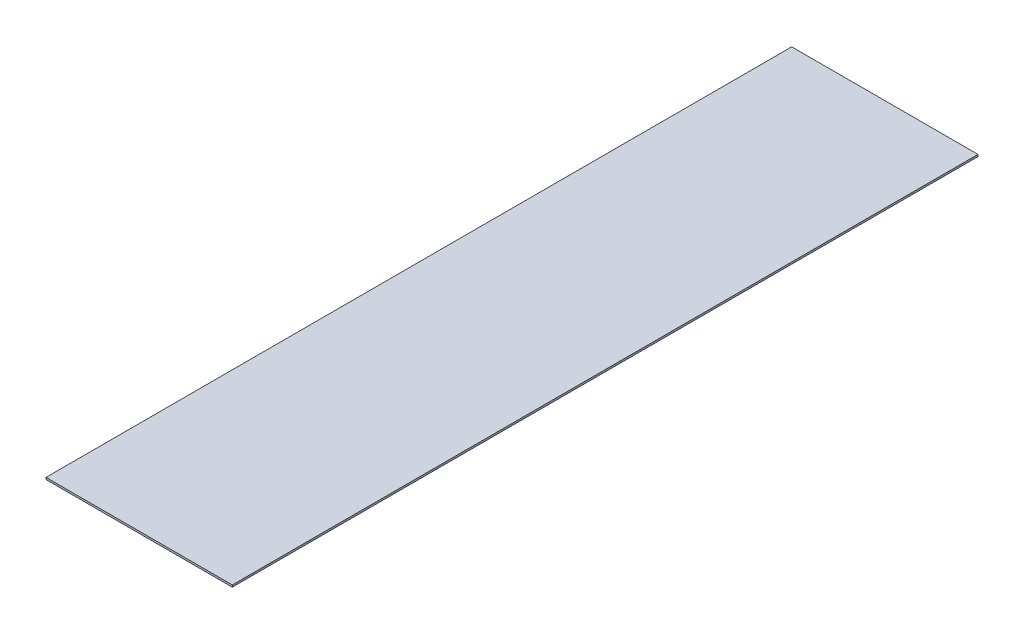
ISO-10303-21;
HEADER;
FILE_DESCRIPTION(('STEP AP214'),'2;1');
FILE_NAME('part.step','',(''),(''),'','','');
FILE_SCHEMA(('AUTOMOTIVE_DESIGN { 1 0 10303 214 1 1 1 1 }'));
ENDSEC;
DATA;
#1=APPLICATION_CONTEXT('core data for automotive mechanical design processes');
#2=APPLICATION_PROTOCOL_DEFINITION('international standard','automotive_design',2000,#1);
#3=PRODUCT_CONTEXT('',#1,'mechanical');
#4=PRODUCT('Part','Part','',(#3));
#5=PRODUCT_RELATED_PRODUCT_CATEGORY('part','',(#4));
#6=PRODUCT_DEFINITION_FORMATION('','',#4);
#7=PRODUCT_DEFINITION_CONTEXT('part definition',#1,'design');
#8=PRODUCT_DEFINITION('design','',#6,#7);
#9=PRODUCT_DEFINITION_SHAPE('','',#8);
#10=(LENGTH_UNIT() NAMED_UNIT(*) SI_UNIT(.MILLI.,.METRE.));
#11=(NAMED_UNIT(*) PLANE_ANGLE_UNIT() SI_UNIT($,.RADIAN.));
#12=(NAMED_UNIT(*) SI_UNIT($,.STERADIAN.) SOLID_ANGLE_UNIT());
#13=UNCERTAINTY_MEASURE_WITH_UNIT(LENGTH_MEASURE(1.E-05),#10,'distance_accuracy_value','');
#14=(GEOMETRIC_REPRESENTATION_CONTEXT(3) GLOBAL_UNCERTAINTY_ASSIGNED_CONTEXT((#13)) GLOBAL_UNIT_ASSIGNED_CONTEXT((#10,
#11,#12)) REPRESENTATION_CONTEXT('',''));
#15=CARTESIAN_POINT('',(0.,0.,0.));
#16=DIRECTION('',(0.,0.,1.));
#17=DIRECTION('',(1.,0.,0.));
#18=AXIS2_PLACEMENT_3D('',#15,#16,#17);
#19=CARTESIAN_POINT('',(-304.8,6.35,-1219.99375));
#20=DIRECTION('',(1.,0.,0.));
#21=DIRECTION('',(0.,0.,-1.));
#22=AXIS2_PLACEMENT_3D('',#19,#20,#21);
#23=PLANE('',#22);
#24=DIRECTION('',(0.,0.,1.));
#25=VECTOR('',#24,1.);
#26=CARTESIAN_POINT('',(-304.8,0.,-1219.99375));
#27=LINE('',#26,#25);
#28=CARTESIAN_POINT('',(-304.8,0.,-1219.99375));
#29=VERTEX_POINT('',#28);
#30=CARTESIAN_POINT('',(-304.8,0.,1219.99375));
#31=VERTEX_POINT('',#30);
#32=EDGE_CURVE('E96',#29,#31,#27,.T.);
#33=ORIENTED_EDGE('',*,*,#32,.T.);
#34=DIRECTION('',(0.,-1.,0.));
#35=VECTOR('',#34,1.);
#36=CARTESIAN_POINT('',(-304.8,6.35,1219.99375));
#37=LINE('',#36,#35);
#38=CARTESIAN_POINT('',(-304.8,6.35,1219.99375));
#39=VERTEX_POINT('',#38);
#40=EDGE_CURVE('E11',#39,#31,#37,.T.);
#41=ORIENTED_EDGE('',*,*,#40,.F.);
#42=DIRECTION('',(0.,0.,1.));
#43=VECTOR('',#42,1.);
#44=CARTESIAN_POINT('',(-304.8,6.35,-1219.99375));
#45=LINE('',#44,#43);
#46=CARTESIAN_POINT('',(-304.8,6.35,-1219.99375));
#47=VERTEX_POINT('',#46);
#48=EDGE_CURVE('E84',#47,#39,#45,.T.);
#49=ORIENTED_EDGE('',*,*,#48,.F.);
#50=DIRECTION('',(0.,-1.,0.));
#51=VECTOR('',#50,1.);
#52=CARTESIAN_POINT('',(-304.8,6.35,-1219.99375));
#53=LINE('',#52,#51);
#54=EDGE_CURVE('E92',#47,#29,#53,.T.);
#55=ORIENTED_EDGE('',*,*,#54,.T.);
#56=EDGE_LOOP('',(#33,#41,#49,#55));
#57=FACE_BOUND('',#56,.T.);
#58=ADVANCED_FACE('F33',(#57),#23,.F.);
#59=CARTESIAN_POINT('',(-304.8,6.35,1219.99375));
#60=DIRECTION('',(0.,0.,-1.));
#61=DIRECTION('',(-1.,0.,0.));
#62=AXIS2_PLACEMENT_3D('',#59,#60,#61);
#63=PLANE('',#62);
#64=DIRECTION('',(1.,0.,0.));
#65=VECTOR('',#64,1.);
#66=CARTESIAN_POINT('',(-304.8,0.,1219.99375));
#67=LINE('',#66,#65);
#68=CARTESIAN_POINT('',(304.8,0.,1219.99375));
#69=VERTEX_POINT('',#68);
#70=EDGE_CURVE('E88',#31,#69,#67,.T.);
#71=ORIENTED_EDGE('',*,*,#70,.T.);
#72=DIRECTION('',(0.,-1.,0.));
#73=VECTOR('',#72,1.);
#74=CARTESIAN_POINT('',(304.8,6.35,1219.99375));
#75=LINE('',#74,#73);
#76=CARTESIAN_POINT('',(304.8,6.35,1219.99375));
#77=VERTEX_POINT('',#76);
#78=EDGE_CURVE('E41',#77,#69,#75,.T.);
#79=ORIENTED_EDGE('',*,*,#78,.F.);
#80=DIRECTION('',(1.,0.,0.));
#81=VECTOR('',#80,1.);
#82=CARTESIAN_POINT('',(-304.8,6.35,1219.99375));
#83=LINE('',#82,#81);
#84=EDGE_CURVE('E79',#39,#77,#83,.T.);
#85=ORIENTED_EDGE('',*,*,#84,.F.);
#86=ORIENTED_EDGE('',*,*,#40,.T.);
#87=EDGE_LOOP('',(#71,#79,#85,#86));
#88=FACE_BOUND('',#87,.T.);
#89=ADVANCED_FACE('F87',(#88),#63,.F.);
#90=CARTESIAN_POINT('',(304.8,6.35,-1219.99375));
#91=DIRECTION('',(-1.,0.,0.));
#92=DIRECTION('',(0.,0.,1.));
#93=AXIS2_PLACEMENT_3D('',#90,#91,#92);
#94=PLANE('',#93);
#95=DIRECTION('',(0.,0.,-1.));
#96=VECTOR('',#95,1.);
#97=CARTESIAN_POINT('',(304.8,0.,-1219.99375));
#98=LINE('',#97,#96);
#99=CARTESIAN_POINT('',(304.8,0.,-1219.99375));
#100=VERTEX_POINT('',#99);
#101=EDGE_CURVE('E66',#69,#100,#98,.T.);
#102=ORIENTED_EDGE('',*,*,#101,.T.);
#103=DIRECTION('',(0.,-1.,0.));
#104=VECTOR('',#103,1.);
#105=CARTESIAN_POINT('',(304.8,6.35,-1219.99375));
#106=LINE('',#105,#104);
#107=CARTESIAN_POINT('',(304.8,6.35,-1219.99375));
#108=VERTEX_POINT('',#107);
#109=EDGE_CURVE('E89',#108,#100,#106,.T.);
#110=ORIENTED_EDGE('',*,*,#109,.F.);
#111=DIRECTION('',(0.,0.,-1.));
#112=VECTOR('',#111,1.);
#113=CARTESIAN_POINT('',(304.8,6.35,-1219.99375));
#114=LINE('',#113,#112);
#115=EDGE_CURVE('E82',#77,#108,#114,.T.);
#116=ORIENTED_EDGE('',*,*,#115,.F.);
#117=ORIENTED_EDGE('',*,*,#78,.T.);
#118=EDGE_LOOP('',(#102,#110,#116,#117));
#119=FACE_BOUND('',#118,.T.);
#120=ADVANCED_FACE('F90',(#119),#94,.F.);
#121=CARTESIAN_POINT('',(-304.8,6.35,-1219.99375));
#122=DIRECTION('',(0.,0.,1.));
#123=DIRECTION('',(1.,0.,0.));
#124=AXIS2_PLACEMENT_3D('',#121,#122,#123);
#125=PLANE('',#124);
#126=DIRECTION('',(-1.,0.,0.));
#127=VECTOR('',#126,1.);
#128=CARTESIAN_POINT('',(-304.8,0.,-1219.99375));
#129=LINE('',#128,#127);
#130=EDGE_CURVE('E72',#100,#29,#129,.T.);
#131=ORIENTED_EDGE('',*,*,#130,.T.);
#132=ORIENTED_EDGE('',*,*,#54,.F.);
#133=DIRECTION('',(-1.,0.,0.));
#134=VECTOR('',#133,1.);
#135=CARTESIAN_POINT('',(-304.8,6.35,-1219.99375));
#136=LINE('',#135,#134);
#137=EDGE_CURVE('E49',#108,#47,#136,.T.);
#138=ORIENTED_EDGE('',*,*,#137,.F.);
#139=ORIENTED_EDGE('',*,*,#109,.T.);
#140=EDGE_LOOP('',(#131,#132,#138,#139));
#141=FACE_BOUND('',#140,.T.);
#142=ADVANCED_FACE('F103',(#141),#125,.F.);
#143=CARTESIAN_POINT('',(0.,6.35,0.));
#144=DIRECTION('',(0.,1.,0.));
#145=DIRECTION('',(0.,0.,1.));
#146=AXIS2_PLACEMENT_3D('',#143,#144,#145);
#147=PLANE('',#146);
#148=ORIENTED_EDGE('',*,*,#48,.T.);
#149=ORIENTED_EDGE('',*,*,#84,.T.);
#150=ORIENTED_EDGE('',*,*,#115,.T.);
#151=ORIENTED_EDGE('',*,*,#137,.T.);
#152=EDGE_LOOP('',(#148,#149,#150,#151));
#153=FACE_BOUND('',#152,.T.);
#154=ADVANCED_FACE('F80',(#153),#147,.T.);
#155=CARTESIAN_POINT('',(0.,0.,0.));
#156=DIRECTION('',(0.,1.,0.));
#157=DIRECTION('',(0.,0.,1.));
#158=AXIS2_PLACEMENT_3D('',#155,#156,#157);
#159=PLANE('',#158);
#160=ORIENTED_EDGE('',*,*,#32,.F.);
#161=ORIENTED_EDGE('',*,*,#130,.F.);
#162=ORIENTED_EDGE('',*,*,#101,.F.);
#163=ORIENTED_EDGE('',*,*,#70,.F.);
#164=EDGE_LOOP('',(#160,#161,#162,#163));
#165=FACE_BOUND('',#164,.T.);
#166=ADVANCED_FACE('F106',(#165),#159,.F.);
#167=CLOSED_SHELL('',(#58,#89,#120,#142,#154,#166));
#168=MANIFOLD_SOLID_BREP('B2',#167);
#169=ADVANCED_BREP_SHAPE_REPRESENTATION('',(#18,#168),#14);
#170=SHAPE_DEFINITION_REPRESENTATION(#9,#169);
ENDSEC;
END-ISO-10303-21;
